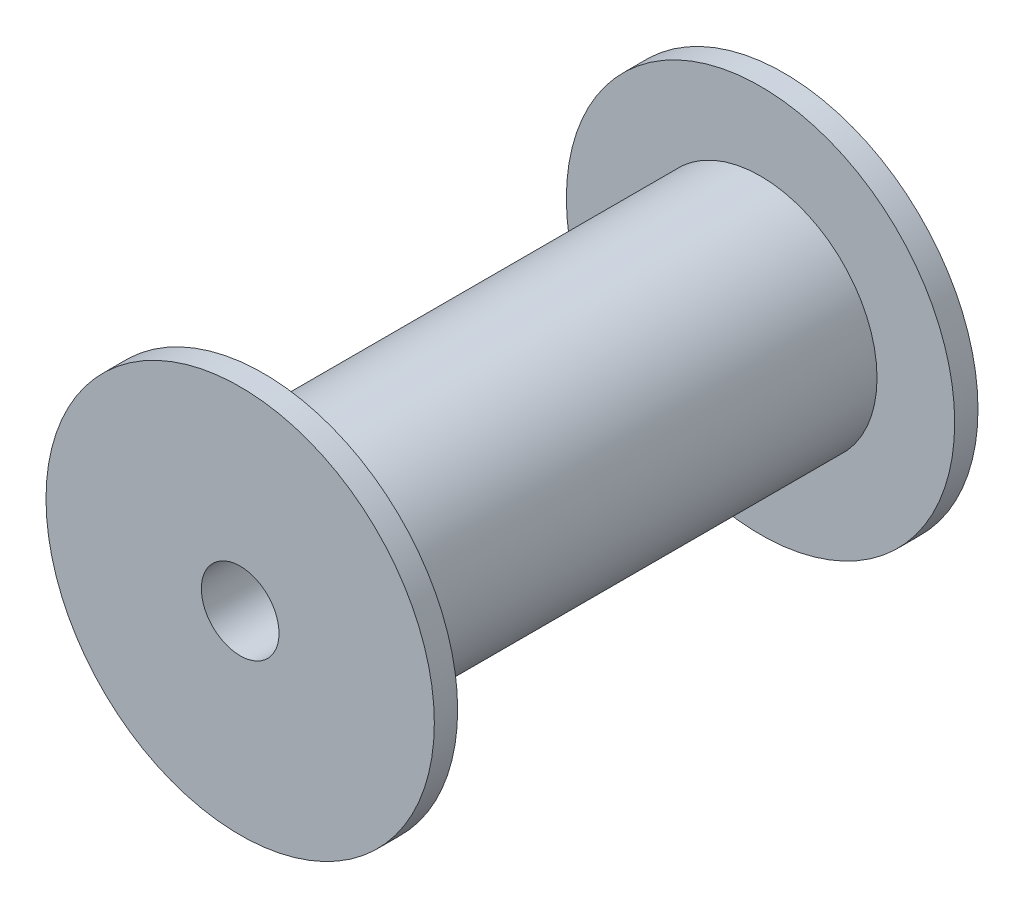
from build123d import *

# Parameters (mm, degrees)
CUERPO_PROFILE_R                     = 15
BRIDA_IZQ_PROFILE_R                  = 25
BRIDA_DCHA_PROFILE_R                 = 25
TALADRO_EJE_PROFILE_R                = 5
ALOJAMIENTO_RODAMIENTO_IZQ_PROFILE_R = 13


with BuildPart() as part:
    # Cuerpo: sweep along a curve in space
    with BuildLine() as cuerpo_path:
        Line((-425.1, 65, -50), (-425.1, 65, 25.5))
    # Cuerpo profile (on start of the path) → Cuerpo (sweep)
    with BuildSketch(Plane(origin=(-425.1, 65, -50), x_dir=(1, 0, 0), z_dir=(0, 0, 1))):
        Circle(CUERPO_PROFILE_R)
    sweep(path=cuerpo_path.line)

    # Brida_izq: sweep along a curve in space
    with BuildLine() as brida_izq_path:
        Line((-425.1, 65, -44.5), (-425.1, 65, -41.5))
    # Brida_izq profile (on start of the path) → Brida_izq (sweep)
    with BuildSketch(Plane(origin=(-425.1, 65, -44.5), x_dir=(1, 0, 0), z_dir=(0, 0, 1))):
        Circle(BRIDA_IZQ_PROFILE_R)
    sweep(path=brida_izq_path.line)

    # Brida_dcha: sweep along a curve in space
    with BuildLine() as brida_dcha_path:
        Line((-425.1, 65, 22.5), (-425.1, 65, 25.5))
    # Brida_dcha profile (on start of the path) → Brida_dcha (sweep)
    with BuildSketch(Plane(origin=(-425.1, 65, 22.5), x_dir=(1, 0, 0), z_dir=(0, 0, 1))):
        Circle(BRIDA_DCHA_PROFILE_R)
    sweep(path=brida_dcha_path.line)

    # Taladro_eje: sweep along a curve in space
    with BuildLine() as taladro_eje_path:
        Line((-425.1, 65, -50), (-425.1, 65, 25.5))
    # Taladro_eje profile (on start of the path) → Taladro_eje (sweep, cut)
    with BuildSketch(Plane(origin=(-425.1, 65, -50), x_dir=(1, 0, 0), z_dir=(0, 0, 1))):
        Circle(TALADRO_EJE_PROFILE_R)
    sweep(path=taladro_eje_path.line, mode=Mode.SUBTRACT)

    # Alojamiento_rodamiento_izq: sweep along a curve in space
    with BuildLine() as alojamiento_rodamiento_izq_path:
        Line((-425.1, 65, -50), (-425.1, 65, -42))
    # Alojamiento_rodamiento_izq profile (on start of the path) → Alojamiento_rodamiento_izq (sweep, cut)
    with BuildSketch(Plane(origin=(-425.1, 65, -50), x_dir=(1, 0, 0), z_dir=(0, 0, 1))):
        Circle(ALOJAMIENTO_RODAMIENTO_IZQ_PROFILE_R)
    sweep(path=alojamiento_rodamiento_izq_path.line, mode=Mode.SUBTRACT)


solid = part.part
